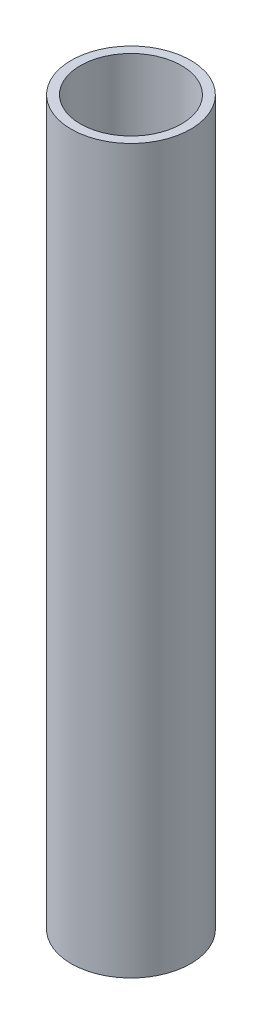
ISO-10303-21;
HEADER;
FILE_DESCRIPTION(('STEP AP214'),'2;1');
FILE_NAME('part.step','',(''),(''),'','','');
FILE_SCHEMA(('AUTOMOTIVE_DESIGN { 1 0 10303 214 1 1 1 1 }'));
ENDSEC;
DATA;
#1=APPLICATION_CONTEXT('core data for automotive mechanical design processes');
#2=APPLICATION_PROTOCOL_DEFINITION('international standard','automotive_design',2000,#1);
#3=PRODUCT_CONTEXT('',#1,'mechanical');
#4=PRODUCT('Part','Part','',(#3));
#5=PRODUCT_RELATED_PRODUCT_CATEGORY('part','',(#4));
#6=PRODUCT_DEFINITION_FORMATION('','',#4);
#7=PRODUCT_DEFINITION_CONTEXT('part definition',#1,'design');
#8=PRODUCT_DEFINITION('design','',#6,#7);
#9=PRODUCT_DEFINITION_SHAPE('','',#8);
#10=(LENGTH_UNIT() NAMED_UNIT(*) SI_UNIT(.MILLI.,.METRE.));
#11=(NAMED_UNIT(*) PLANE_ANGLE_UNIT() SI_UNIT($,.RADIAN.));
#12=(NAMED_UNIT(*) SI_UNIT($,.STERADIAN.) SOLID_ANGLE_UNIT());
#13=UNCERTAINTY_MEASURE_WITH_UNIT(LENGTH_MEASURE(1.E-05),#10,'distance_accuracy_value','');
#14=(GEOMETRIC_REPRESENTATION_CONTEXT(3) GLOBAL_UNCERTAINTY_ASSIGNED_CONTEXT((#13)) GLOBAL_UNIT_ASSIGNED_CONTEXT((#10,
#11,#12)) REPRESENTATION_CONTEXT('',''));
#15=CARTESIAN_POINT('',(0.,0.,0.));
#16=DIRECTION('',(0.,0.,1.));
#17=DIRECTION('',(1.,0.,0.));
#18=AXIS2_PLACEMENT_3D('',#15,#16,#17);
#19=CARTESIAN_POINT('',(0.,146.05,0.));
#20=DIRECTION('',(0.,1.,0.));
#21=DIRECTION('',(0.,0.,1.));
#22=AXIS2_PLACEMENT_3D('',#19,#20,#21);
#23=PLANE('',#22);
#24=CARTESIAN_POINT('',(0.,146.05,0.));
#25=DIRECTION('',(0.,1.,0.));
#26=DIRECTION('',(0.,0.,1.));
#27=AXIS2_PLACEMENT_3D('',#24,#25,#26);
#28=CIRCLE('',#27,24.13);
#29=CARTESIAN_POINT('',(0.,146.05,24.13));
#30=VERTEX_POINT('',#29);
#31=EDGE_CURVE('E10',#30,#30,#28,.T.);
#32=ORIENTED_EDGE('',*,*,#31,.T.);
#33=EDGE_LOOP('',(#32));
#34=FACE_BOUND('',#33,.T.);
#35=CARTESIAN_POINT('',(0.,146.05,0.));
#36=DIRECTION('',(0.,1.,0.));
#37=DIRECTION('',(0.,0.,1.));
#38=AXIS2_PLACEMENT_3D('',#35,#36,#37);
#39=CIRCLE('',#38,20.447);
#40=CARTESIAN_POINT('',(0.,146.05,20.447));
#41=VERTEX_POINT('',#40);
#42=EDGE_CURVE('E39',#41,#41,#39,.T.);
#43=ORIENTED_EDGE('',*,*,#42,.F.);
#44=EDGE_LOOP('',(#43));
#45=FACE_BOUND('',#44,.T.);
#46=ADVANCED_FACE('F28',(#34,#45),#23,.T.);
#47=CARTESIAN_POINT('',(0.,-146.05,0.));
#48=DIRECTION('',(0.,1.,0.));
#49=DIRECTION('',(0.,0.,1.));
#50=AXIS2_PLACEMENT_3D('',#47,#48,#49);
#51=PLANE('',#50);
#52=CARTESIAN_POINT('',(0.,-146.05,0.));
#53=DIRECTION('',(0.,1.,0.));
#54=DIRECTION('',(0.,0.,1.));
#55=AXIS2_PLACEMENT_3D('',#52,#53,#54);
#56=CIRCLE('',#55,24.13);
#57=CARTESIAN_POINT('',(0.,-146.05,24.13));
#58=VERTEX_POINT('',#57);
#59=EDGE_CURVE('E32',#58,#58,#56,.T.);
#60=ORIENTED_EDGE('',*,*,#59,.F.);
#61=EDGE_LOOP('',(#60));
#62=FACE_BOUND('',#61,.T.);
#63=CARTESIAN_POINT('',(0.,-146.05,0.));
#64=DIRECTION('',(0.,1.,0.));
#65=DIRECTION('',(0.,0.,1.));
#66=AXIS2_PLACEMENT_3D('',#63,#64,#65);
#67=CIRCLE('',#66,20.447);
#68=CARTESIAN_POINT('',(0.,-146.05,20.447));
#69=VERTEX_POINT('',#68);
#70=EDGE_CURVE('E41',#69,#69,#67,.T.);
#71=ORIENTED_EDGE('',*,*,#70,.T.);
#72=EDGE_LOOP('',(#71));
#73=FACE_BOUND('',#72,.T.);
#74=ADVANCED_FACE('F51',(#62,#73),#51,.F.);
#75=CARTESIAN_POINT('',(0.,146.05,0.));
#76=DIRECTION('',(0.,-1.,0.));
#77=DIRECTION('',(0.,0.,-1.));
#78=AXIS2_PLACEMENT_3D('',#75,#76,#77);
#79=CYLINDRICAL_SURFACE('',#78,24.13);
#80=ORIENTED_EDGE('',*,*,#31,.F.);
#81=EDGE_LOOP('',(#80));
#82=FACE_BOUND('',#81,.T.);
#83=ORIENTED_EDGE('',*,*,#59,.T.);
#84=EDGE_LOOP('',(#83));
#85=FACE_BOUND('',#84,.T.);
#86=ADVANCED_FACE('F30',(#82,#85),#79,.T.);
#87=CARTESIAN_POINT('',(0.,146.05,0.));
#88=DIRECTION('',(0.,-1.,0.));
#89=DIRECTION('',(0.,0.,-1.));
#90=AXIS2_PLACEMENT_3D('',#87,#88,#89);
#91=CYLINDRICAL_SURFACE('',#90,20.447);
#92=ORIENTED_EDGE('',*,*,#42,.T.);
#93=EDGE_LOOP('',(#92));
#94=FACE_BOUND('',#93,.T.);
#95=ORIENTED_EDGE('',*,*,#70,.F.);
#96=EDGE_LOOP('',(#95));
#97=FACE_BOUND('',#96,.T.);
#98=ADVANCED_FACE('F47',(#94,#97),#91,.F.);
#99=CLOSED_SHELL('',(#46,#74,#86,#98));
#100=MANIFOLD_SOLID_BREP('B2',#99);
#101=ADVANCED_BREP_SHAPE_REPRESENTATION('',(#18,#100),#14);
#102=SHAPE_DEFINITION_REPRESENTATION(#9,#101);
ENDSEC;
END-ISO-10303-21;
